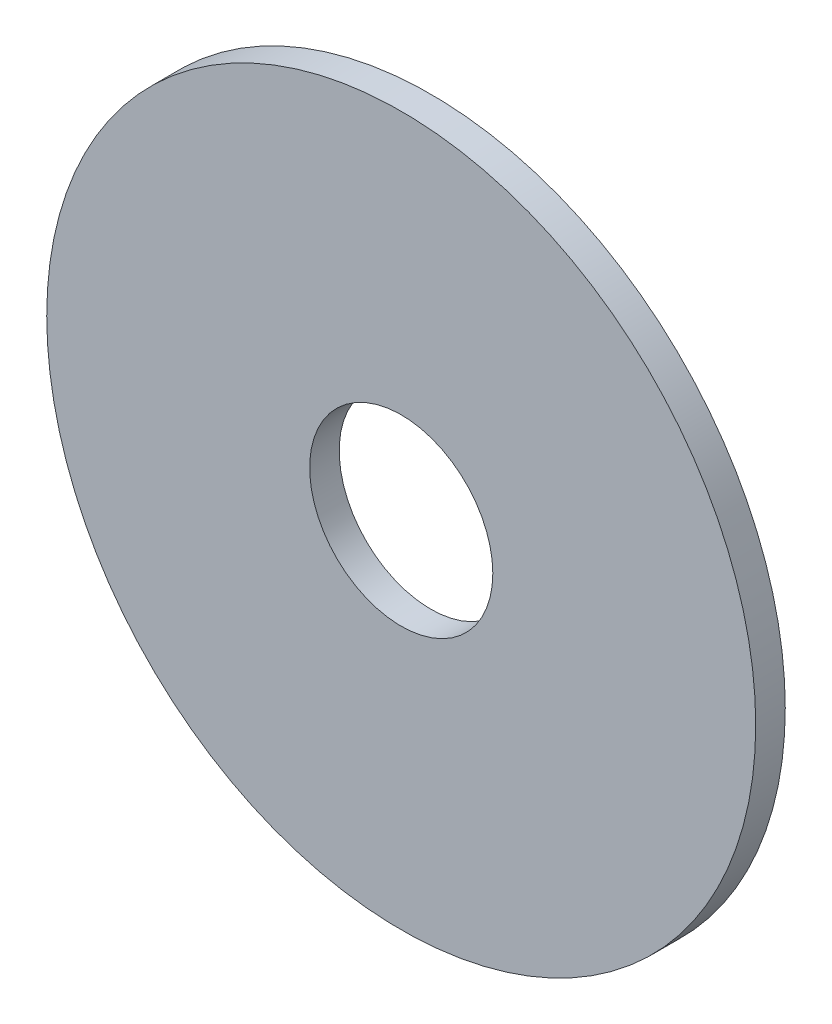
ISO-10303-21;
HEADER;
FILE_DESCRIPTION(('STEP AP214'),'2;1');
FILE_NAME('part.step','',(''),(''),'','','');
FILE_SCHEMA(('AUTOMOTIVE_DESIGN { 1 0 10303 214 1 1 1 1 }'));
ENDSEC;
DATA;
#1=APPLICATION_CONTEXT('core data for automotive mechanical design processes');
#2=APPLICATION_PROTOCOL_DEFINITION('international standard','automotive_design',2000,#1);
#3=PRODUCT_CONTEXT('',#1,'mechanical');
#4=PRODUCT('Part','Part','',(#3));
#5=PRODUCT_RELATED_PRODUCT_CATEGORY('part','',(#4));
#6=PRODUCT_DEFINITION_FORMATION('','',#4);
#7=PRODUCT_DEFINITION_CONTEXT('part definition',#1,'design');
#8=PRODUCT_DEFINITION('design','',#6,#7);
#9=PRODUCT_DEFINITION_SHAPE('','',#8);
#10=(LENGTH_UNIT() NAMED_UNIT(*) SI_UNIT(.MILLI.,.METRE.));
#11=(NAMED_UNIT(*) PLANE_ANGLE_UNIT() SI_UNIT($,.RADIAN.));
#12=(NAMED_UNIT(*) SI_UNIT($,.STERADIAN.) SOLID_ANGLE_UNIT());
#13=UNCERTAINTY_MEASURE_WITH_UNIT(LENGTH_MEASURE(1.E-05),#10,'distance_accuracy_value','');
#14=(GEOMETRIC_REPRESENTATION_CONTEXT(3) GLOBAL_UNCERTAINTY_ASSIGNED_CONTEXT((#13)) GLOBAL_UNIT_ASSIGNED_CONTEXT((#10,
#11,#12)) REPRESENTATION_CONTEXT('',''));
#15=CARTESIAN_POINT('',(0.,0.,0.));
#16=DIRECTION('',(0.,0.,1.));
#17=DIRECTION('',(1.,0.,0.));
#18=AXIS2_PLACEMENT_3D('',#15,#16,#17);
#19=CARTESIAN_POINT('',(0.,0.,0.5));
#20=DIRECTION('',(0.,0.,1.));
#21=DIRECTION('',(1.,0.,0.));
#22=AXIS2_PLACEMENT_3D('',#19,#20,#21);
#23=PLANE('',#22);
#24=CARTESIAN_POINT('',(0.,0.,0.5));
#25=DIRECTION('',(0.,0.,1.));
#26=DIRECTION('',(1.,0.,0.));
#27=AXIS2_PLACEMENT_3D('',#24,#25,#26);
#28=CIRCLE('',#27,6.);
#29=CARTESIAN_POINT('',(6.,0.,0.5));
#30=VERTEX_POINT('',#29);
#31=EDGE_CURVE('E10',#30,#30,#28,.T.);
#32=ORIENTED_EDGE('',*,*,#31,.T.);
#33=EDGE_LOOP('',(#32));
#34=FACE_BOUND('',#33,.T.);
#35=CARTESIAN_POINT('',(0.,0.,0.5));
#36=DIRECTION('',(0.,0.,1.));
#37=DIRECTION('',(1.,0.,0.));
#38=AXIS2_PLACEMENT_3D('',#35,#36,#37);
#39=CIRCLE('',#38,1.55);
#40=CARTESIAN_POINT('',(1.55,0.,0.5));
#41=VERTEX_POINT('',#40);
#42=EDGE_CURVE('E46',#41,#41,#39,.T.);
#43=ORIENTED_EDGE('',*,*,#42,.F.);
#44=EDGE_LOOP('',(#43));
#45=FACE_BOUND('',#44,.T.);
#46=ADVANCED_FACE('F35',(#34,#45),#23,.T.);
#47=CARTESIAN_POINT('',(0.,0.,0.));
#48=DIRECTION('',(0.,0.,1.));
#49=DIRECTION('',(1.,0.,0.));
#50=AXIS2_PLACEMENT_3D('',#47,#48,#49);
#51=PLANE('',#50);
#52=CARTESIAN_POINT('',(0.,0.,0.));
#53=DIRECTION('',(0.,0.,1.));
#54=DIRECTION('',(1.,0.,0.));
#55=AXIS2_PLACEMENT_3D('',#52,#53,#54);
#56=CIRCLE('',#55,6.);
#57=CARTESIAN_POINT('',(6.,0.,0.));
#58=VERTEX_POINT('',#57);
#59=EDGE_CURVE('E39',#58,#58,#56,.T.);
#60=ORIENTED_EDGE('',*,*,#59,.F.);
#61=EDGE_LOOP('',(#60));
#62=FACE_BOUND('',#61,.T.);
#63=CARTESIAN_POINT('',(0.,0.,0.));
#64=DIRECTION('',(0.,0.,1.));
#65=DIRECTION('',(1.,0.,0.));
#66=AXIS2_PLACEMENT_3D('',#63,#64,#65);
#67=CIRCLE('',#66,1.55);
#68=CARTESIAN_POINT('',(1.55,0.,0.));
#69=VERTEX_POINT('',#68);
#70=EDGE_CURVE('E48',#69,#69,#67,.T.);
#71=ORIENTED_EDGE('',*,*,#70,.T.);
#72=EDGE_LOOP('',(#71));
#73=FACE_BOUND('',#72,.T.);
#74=ADVANCED_FACE('F58',(#62,#73),#51,.F.);
#75=CARTESIAN_POINT('',(0.,0.,0.5));
#76=DIRECTION('',(0.,0.,-1.));
#77=DIRECTION('',(-1.,0.,0.));
#78=AXIS2_PLACEMENT_3D('',#75,#76,#77);
#79=CYLINDRICAL_SURFACE('',#78,6.);
#80=ORIENTED_EDGE('',*,*,#31,.F.);
#81=EDGE_LOOP('',(#80));
#82=FACE_BOUND('',#81,.T.);
#83=ORIENTED_EDGE('',*,*,#59,.T.);
#84=EDGE_LOOP('',(#83));
#85=FACE_BOUND('',#84,.T.);
#86=ADVANCED_FACE('F37',(#82,#85),#79,.T.);
#87=CARTESIAN_POINT('',(0.,0.,0.5));
#88=DIRECTION('',(0.,0.,-1.));
#89=DIRECTION('',(-1.,0.,0.));
#90=AXIS2_PLACEMENT_3D('',#87,#88,#89);
#91=CYLINDRICAL_SURFACE('',#90,1.55);
#92=ORIENTED_EDGE('',*,*,#42,.T.);
#93=EDGE_LOOP('',(#92));
#94=FACE_BOUND('',#93,.T.);
#95=ORIENTED_EDGE('',*,*,#70,.F.);
#96=EDGE_LOOP('',(#95));
#97=FACE_BOUND('',#96,.T.);
#98=ADVANCED_FACE('F54',(#94,#97),#91,.F.);
#99=CLOSED_SHELL('',(#46,#74,#86,#98));
#100=MANIFOLD_SOLID_BREP('B2',#99);
#101=ADVANCED_BREP_SHAPE_REPRESENTATION('',(#18,#100),#14);
#102=SHAPE_DEFINITION_REPRESENTATION(#9,#101);
ENDSEC;
END-ISO-10303-21;
